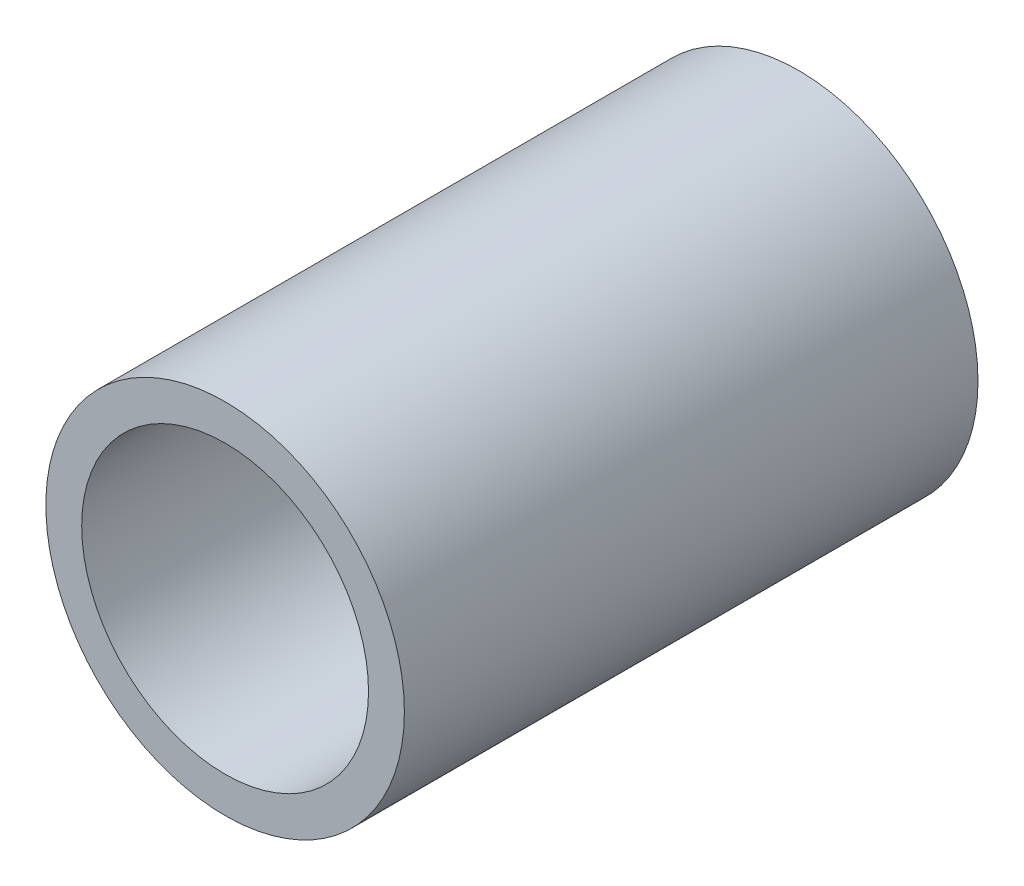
from build123d import *

# Parameters (mm, degrees)
ESQUISSE1_R      = 62.5
ESQUISSE1_R_2    = 50
EXTRUSION1_DEPTH = 200


with BuildPart() as part:
    # Esquisse1 → Extrusion1 (new body)
    with BuildSketch(Plane.XY):
        Circle(ESQUISSE1_R)
        Circle(ESQUISSE1_R_2, mode=Mode.SUBTRACT)
    extrude(amount=EXTRUSION1_DEPTH)


solid = part.part
